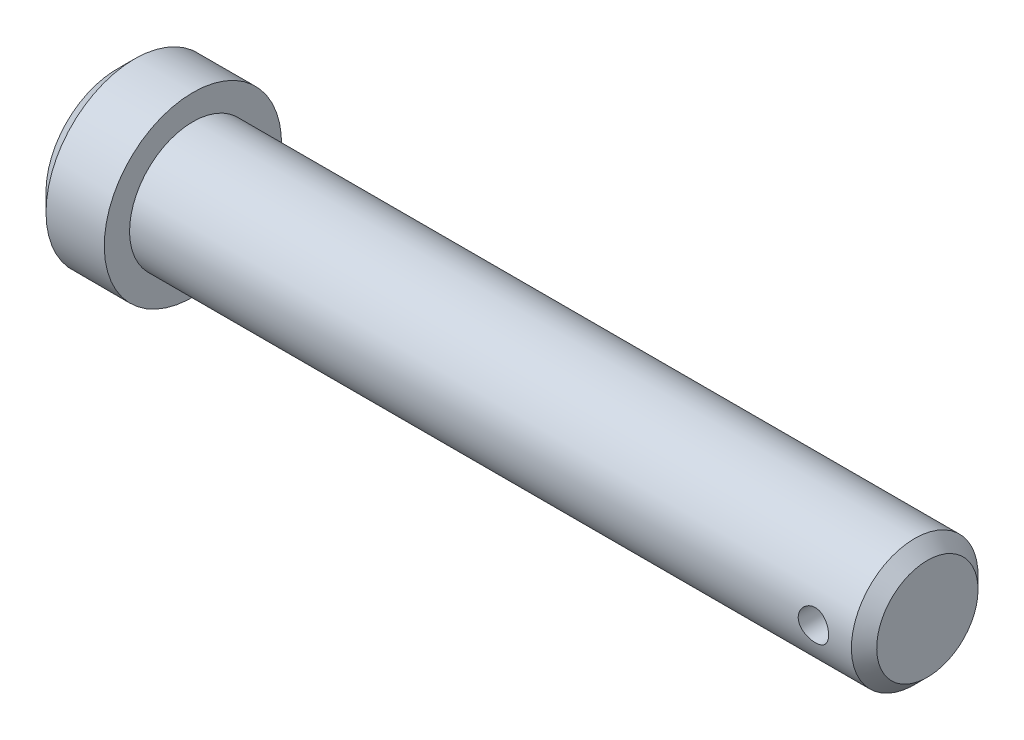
from build123d import *

# Parameters (mm, degrees)
CUT_EXTRUDE_1_DEPTH      = 33.380549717
CUT_EXTRUDE_1_DEPTH_BACK = 33.380549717
SKETCH_2_R               = 0.6
CHAMFER_1_SIZE           = 0.7
CHAMFER_2_SIZE           = 0.5


with BuildPart() as part:
    # Sketch 1 → Revolve 1 (revolve)
    with BuildSketch(Plane.XY):
        Polygon((0, 0), (0, 3.5), (3, 3.5), (3, 2.5), (32, 2.5), (32, 0), align=None)
    revolve(axis=Axis((32, 0, 0), (-1, 0, 0)))

    # Sketch 2 → Cut-Extrude 1 (cut, two sides: drawn at the far end of the back side and taken through both)
    with BuildSketch(Plane.XY.offset(-CUT_EXTRUDE_1_DEPTH_BACK)):
        with Locations((30, 0)):
            Circle(SKETCH_2_R)
    extrude(amount=CUT_EXTRUDE_1_DEPTH + CUT_EXTRUDE_1_DEPTH_BACK, mode=Mode.SUBTRACT)

    # Chamfer 1
    chamfer_1_edges = [part.edges().sort_by_distance(p)[0] for p in [
        (0, -3.5, 0),
    ]]
    chamfer(chamfer_1_edges, length=CHAMFER_1_SIZE)

    # Chamfer 2
    chamfer_2_edges = [part.edges().sort_by_distance(p)[0] for p in [
        (32, -2.5, 0),
    ]]
    chamfer(chamfer_2_edges, length=CHAMFER_2_SIZE)


solid = part.part
